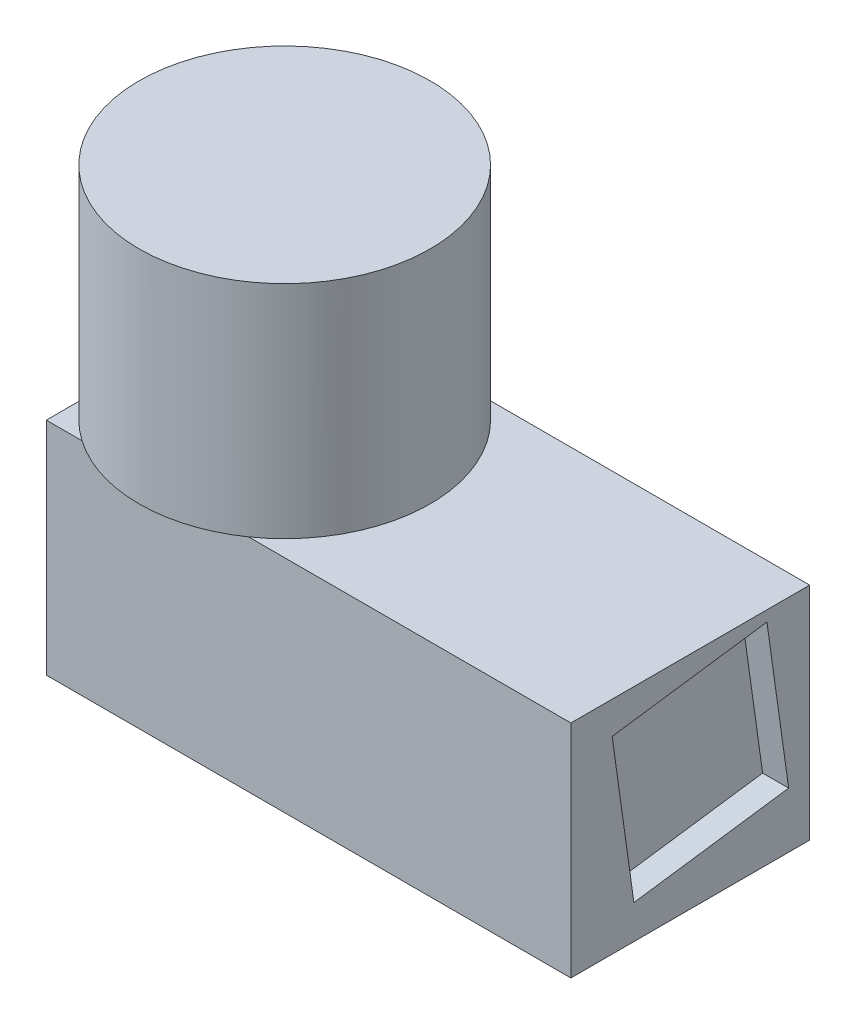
ISO-10303-21;
HEADER;
FILE_DESCRIPTION(('STEP AP214'),'2;1');
FILE_NAME('part.step','',(''),(''),'','','');
FILE_SCHEMA(('AUTOMOTIVE_DESIGN { 1 0 10303 214 1 1 1 1 }'));
ENDSEC;
DATA;
#1=APPLICATION_CONTEXT('core data for automotive mechanical design processes');
#2=APPLICATION_PROTOCOL_DEFINITION('international standard','automotive_design',2000,#1);
#3=PRODUCT_CONTEXT('',#1,'mechanical');
#4=PRODUCT('Part','Part','',(#3));
#5=PRODUCT_RELATED_PRODUCT_CATEGORY('part','',(#4));
#6=PRODUCT_DEFINITION_FORMATION('','',#4);
#7=PRODUCT_DEFINITION_CONTEXT('part definition',#1,'design');
#8=PRODUCT_DEFINITION('design','',#6,#7);
#9=PRODUCT_DEFINITION_SHAPE('','',#8);
#10=(LENGTH_UNIT() NAMED_UNIT(*) SI_UNIT(.MILLI.,.METRE.));
#11=(NAMED_UNIT(*) PLANE_ANGLE_UNIT() SI_UNIT($,.RADIAN.));
#12=(NAMED_UNIT(*) SI_UNIT($,.STERADIAN.) SOLID_ANGLE_UNIT());
#13=UNCERTAINTY_MEASURE_WITH_UNIT(LENGTH_MEASURE(1.E-05),#10,'distance_accuracy_value','');
#14=(GEOMETRIC_REPRESENTATION_CONTEXT(3) GLOBAL_UNCERTAINTY_ASSIGNED_CONTEXT((#13)) GLOBAL_UNIT_ASSIGNED_CONTEXT((#10,
#11,#12)) REPRESENTATION_CONTEXT('',''));
#15=CARTESIAN_POINT('',(0.,0.,0.));
#16=DIRECTION('',(0.,0.,1.));
#17=DIRECTION('',(1.,0.,0.));
#18=AXIS2_PLACEMENT_3D('',#15,#16,#17);
#19=CARTESIAN_POINT('',(0.,53.848,0.));
#20=DIRECTION('',(0.,-1.,0.));
#21=DIRECTION('',(0.,0.,-1.));
#22=AXIS2_PLACEMENT_3D('',#19,#20,#21);
#23=PLANE('',#22);
#24=CARTESIAN_POINT('',(-34.943095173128,53.848,0.));
#25=DIRECTION('',(0.,-1.,0.));
#26=DIRECTION('',(0.,0.,-1.));
#27=AXIS2_PLACEMENT_3D('',#24,#25,#26);
#28=CIRCLE('',#27,35.4944784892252);
#29=CARTESIAN_POINT('',(-63.9482717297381,53.848,20.4586836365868));
#30=VERTEX_POINT('',#29);
#31=CARTESIAN_POINT('',(-55.2485710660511,53.848,29.1126373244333));
#32=VERTEX_POINT('',#31);
#33=EDGE_CURVE('E134',#30,#32,#28,.F.);
#34=ORIENTED_EDGE('',*,*,#33,.F.);
#35=DIRECTION('',(0.,0.,1.));
#36=VECTOR('',#35,1.);
#37=CARTESIAN_POINT('',(-63.9482717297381,53.848,29.1126373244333));
#38=LINE('',#37,#36);
#39=CARTESIAN_POINT('',(-63.9482717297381,53.848,29.1126373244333));
#40=VERTEX_POINT('',#39);
#41=EDGE_CURVE('E173',#30,#40,#38,.T.);
#42=ORIENTED_EDGE('',*,*,#41,.T.);
#43=DIRECTION('',(1.,0.,0.));
#44=VECTOR('',#43,1.);
#45=CARTESIAN_POINT('',(-91.909930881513,53.848,29.1126373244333));
#46=LINE('',#45,#44);
#47=EDGE_CURVE('E146',#40,#32,#46,.T.);
#48=ORIENTED_EDGE('',*,*,#47,.T.);
#49=EDGE_LOOP('',(#34,#42,#48));
#50=FACE_BOUND('',#49,.T.);
#51=ADVANCED_FACE('F41',(#50),#23,.F.);
#52=CARTESIAN_POINT('',(-63.9482717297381,53.848,-20.4586836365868));
#53=VERTEX_POINT('',#52);
#54=EDGE_CURVE('E59',#53,#30,#38,.T.);
#55=ORIENTED_EDGE('',*,*,#54,.T.);
#56=EDGE_CURVE('E137',#53,#30,#28,.F.);
#57=ORIENTED_EDGE('',*,*,#56,.F.);
#58=EDGE_LOOP('',(#55,#57));
#59=FACE_BOUND('',#58,.T.);
#60=ADVANCED_FACE('F258',(#59),#23,.T.);
#61=CARTESIAN_POINT('',(-34.943095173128,53.848,0.));
#62=DIRECTION('',(0.,-1.,0.));
#63=DIRECTION('',(0.,0.,-1.));
#64=AXIS2_PLACEMENT_3D('',#61,#62,#63);
#65=CIRCLE('',#64,35.4944784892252);
#66=CARTESIAN_POINT('',(-14.6376192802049,53.848,29.1126373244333));
#67=VERTEX_POINT('',#66);
#68=CARTESIAN_POINT('',(-14.6376192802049,53.848,-29.1126373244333));
#69=VERTEX_POINT('',#68);
#70=EDGE_CURVE('E12',#67,#69,#65,.F.);
#71=ORIENTED_EDGE('',*,*,#70,.F.);
#72=DIRECTION('',(1.,0.,0.));
#73=VECTOR('',#72,1.);
#74=CARTESIAN_POINT('',(-91.909930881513,53.848,29.1126373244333));
#75=LINE('',#74,#73);
#76=CARTESIAN_POINT('',(63.9482717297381,53.848,29.1126373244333));
#77=VERTEX_POINT('',#76);
#78=EDGE_CURVE('E147',#67,#77,#75,.T.);
#79=ORIENTED_EDGE('',*,*,#78,.T.);
#80=DIRECTION('',(0.,0.,-1.));
#81=VECTOR('',#80,1.);
#82=CARTESIAN_POINT('',(63.9482717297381,53.848,29.1126373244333));
#83=LINE('',#82,#81);
#84=CARTESIAN_POINT('',(63.9482717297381,53.848,-29.1126373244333));
#85=VERTEX_POINT('',#84);
#86=EDGE_CURVE('E157',#77,#85,#83,.T.);
#87=ORIENTED_EDGE('',*,*,#86,.T.);
#88=DIRECTION('',(-1.,0.,0.));
#89=VECTOR('',#88,1.);
#90=CARTESIAN_POINT('',(-63.9482717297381,53.848,-29.1126373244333));
#91=LINE('',#90,#89);
#92=EDGE_CURVE('E169',#85,#69,#91,.T.);
#93=ORIENTED_EDGE('',*,*,#92,.T.);
#94=EDGE_LOOP('',(#71,#79,#87,#93));
#95=FACE_BOUND('',#94,.T.);
#96=ADVANCED_FACE('F240',(#95),#23,.F.);
#97=DIRECTION('',(1.,0.,0.));
#98=VECTOR('',#97,1.);
#99=CARTESIAN_POINT('',(-91.909930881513,53.848,29.1126373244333));
#100=LINE('',#99,#98);
#101=EDGE_CURVE('E143',#32,#67,#100,.T.);
#102=ORIENTED_EDGE('',*,*,#101,.T.);
#103=CARTESIAN_POINT('',(-34.943095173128,53.848,0.));
#104=DIRECTION('',(0.,-1.,0.));
#105=DIRECTION('',(0.,0.,-1.));
#106=AXIS2_PLACEMENT_3D('',#103,#104,#105);
#107=CIRCLE('',#106,35.4944784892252);
#108=EDGE_CURVE('E51',#32,#67,#107,.F.);
#109=ORIENTED_EDGE('',*,*,#108,.F.);
#110=EDGE_LOOP('',(#102,#109));
#111=FACE_BOUND('',#110,.T.);
#112=ADVANCED_FACE('F248',(#111),#23,.T.);
#113=CARTESIAN_POINT('',(-55.2485710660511,53.848,-29.1126373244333));
#114=VERTEX_POINT('',#113);
#115=EDGE_CURVE('E180',#69,#114,#91,.T.);
#116=ORIENTED_EDGE('',*,*,#115,.T.);
#117=CARTESIAN_POINT('',(-34.943095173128,53.848,0.));
#118=DIRECTION('',(0.,-1.,0.));
#119=DIRECTION('',(0.,0.,-1.));
#120=AXIS2_PLACEMENT_3D('',#117,#118,#119);
#121=CIRCLE('',#120,35.4944784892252);
#122=EDGE_CURVE('E129',#69,#114,#121,.F.);
#123=ORIENTED_EDGE('',*,*,#122,.F.);
#124=EDGE_LOOP('',(#116,#123));
#125=FACE_BOUND('',#124,.T.);
#126=ADVANCED_FACE('F245',(#125),#23,.T.);
#127=CARTESIAN_POINT('',(-63.9482717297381,53.848,-29.1126373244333));
#128=VERTEX_POINT('',#127);
#129=EDGE_CURVE('E154',#128,#53,#38,.T.);
#130=ORIENTED_EDGE('',*,*,#129,.T.);
#131=EDGE_CURVE('E132',#114,#53,#28,.F.);
#132=ORIENTED_EDGE('',*,*,#131,.F.);
#133=EDGE_CURVE('E181',#114,#128,#91,.T.);
#134=ORIENTED_EDGE('',*,*,#133,.T.);
#135=EDGE_LOOP('',(#130,#132,#134));
#136=FACE_BOUND('',#135,.T.);
#137=ADVANCED_FACE('F247',(#136),#23,.F.);
#138=CARTESIAN_POINT('',(-63.9482717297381,53.848,29.1126373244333));
#139=DIRECTION('',(1.,0.,0.));
#140=DIRECTION('',(0.,0.,-1.));
#141=AXIS2_PLACEMENT_3D('',#138,#139,#140);
#142=PLANE('',#141);
#143=DIRECTION('',(0.,0.,1.));
#144=VECTOR('',#143,1.);
#145=CARTESIAN_POINT('',(-63.9482717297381,0.,29.1126373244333));
#146=LINE('',#145,#144);
#147=CARTESIAN_POINT('',(-63.9482717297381,0.,-29.1126373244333));
#148=VERTEX_POINT('',#147);
#149=CARTESIAN_POINT('',(-63.9482717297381,0.,29.1126373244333));
#150=VERTEX_POINT('',#149);
#151=EDGE_CURVE('E142',#148,#150,#146,.T.);
#152=ORIENTED_EDGE('',*,*,#151,.T.);
#153=DIRECTION('',(0.,-1.,0.));
#154=VECTOR('',#153,1.);
#155=CARTESIAN_POINT('',(-63.9482717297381,53.848,29.1126373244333));
#156=LINE('',#155,#154);
#157=EDGE_CURVE('E133',#40,#150,#156,.T.);
#158=ORIENTED_EDGE('',*,*,#157,.F.);
#159=ORIENTED_EDGE('',*,*,#41,.F.);
#160=ORIENTED_EDGE('',*,*,#54,.F.);
#161=ORIENTED_EDGE('',*,*,#129,.F.);
#162=DIRECTION('',(0.,-1.,0.));
#163=VECTOR('',#162,1.);
#164=CARTESIAN_POINT('',(-63.9482717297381,53.848,-29.1126373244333));
#165=LINE('',#164,#163);
#166=EDGE_CURVE('E166',#128,#148,#165,.T.);
#167=ORIENTED_EDGE('',*,*,#166,.T.);
#168=EDGE_LOOP('',(#152,#158,#159,#160,#161,#167));
#169=FACE_BOUND('',#168,.T.);
#170=ADVANCED_FACE('F205',(#169),#142,.F.);
#171=CARTESIAN_POINT('',(-91.909930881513,53.848,29.1126373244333));
#172=DIRECTION('',(0.,0.,-1.));
#173=DIRECTION('',(-1.,0.,0.));
#174=AXIS2_PLACEMENT_3D('',#171,#172,#173);
#175=PLANE('',#174);
#176=DIRECTION('',(1.,0.,0.));
#177=VECTOR('',#176,1.);
#178=CARTESIAN_POINT('',(-91.909930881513,0.,29.1126373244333));
#179=LINE('',#178,#177);
#180=CARTESIAN_POINT('',(63.9482717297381,0.,29.1126373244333));
#181=VERTEX_POINT('',#180);
#182=EDGE_CURVE('E160',#150,#181,#179,.T.);
#183=ORIENTED_EDGE('',*,*,#182,.T.);
#184=DIRECTION('',(0.,-1.,0.));
#185=VECTOR('',#184,1.);
#186=CARTESIAN_POINT('',(63.9482717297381,53.848,29.1126373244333));
#187=LINE('',#186,#185);
#188=EDGE_CURVE('E148',#77,#181,#187,.T.);
#189=ORIENTED_EDGE('',*,*,#188,.F.);
#190=ORIENTED_EDGE('',*,*,#78,.F.);
#191=ORIENTED_EDGE('',*,*,#101,.F.);
#192=ORIENTED_EDGE('',*,*,#47,.F.);
#193=ORIENTED_EDGE('',*,*,#157,.T.);
#194=EDGE_LOOP('',(#183,#189,#190,#191,#192,#193));
#195=FACE_BOUND('',#194,.T.);
#196=ADVANCED_FACE('F203',(#195),#175,.F.);
#197=CARTESIAN_POINT('',(63.9482717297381,53.848,29.1126373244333));
#198=DIRECTION('',(-1.,0.,0.));
#199=DIRECTION('',(0.,0.,1.));
#200=AXIS2_PLACEMENT_3D('',#197,#198,#199);
#201=PLANE('',#200);
#202=DIRECTION('',(0.,0.139173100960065,-0.99026806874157));
#203=VECTOR('',#202,1.);
#204=CARTESIAN_POINT('',(63.9482717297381,8.24478658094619,13.7475048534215));
#205=LINE('',#204,#203);
#206=CARTESIAN_POINT('',(63.9482717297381,8.24478658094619,13.7475048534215));
#207=VERTEX_POINT('',#206);
#208=CARTESIAN_POINT('',(63.9482717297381,13.5472817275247,-23.9817085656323));
#209=VERTEX_POINT('',#208);
#210=EDGE_CURVE('E45',#207,#209,#205,.T.);
#211=ORIENTED_EDGE('',*,*,#210,.F.);
#212=DIRECTION('',(0.,-0.99026806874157,-0.139173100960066));
#213=VECTOR('',#212,1.);
#214=CARTESIAN_POINT('',(63.9482717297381,45.974,19.05));
#215=LINE('',#214,#213);
#216=CARTESIAN_POINT('',(63.9482717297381,45.974,19.05));
#217=VERTEX_POINT('',#216);
#218=EDGE_CURVE('E106',#217,#207,#215,.T.);
#219=ORIENTED_EDGE('',*,*,#218,.F.);
#220=DIRECTION('',(0.,-0.139173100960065,0.99026806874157));
#221=VECTOR('',#220,1.);
#222=CARTESIAN_POINT('',(63.9482717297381,45.974,19.05));
#223=LINE('',#222,#221);
#224=CARTESIAN_POINT('',(63.9482717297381,51.2764951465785,-18.6792134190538));
#225=VERTEX_POINT('',#224);
#226=EDGE_CURVE('E110',#225,#217,#223,.T.);
#227=ORIENTED_EDGE('',*,*,#226,.F.);
#228=DIRECTION('',(0.,0.99026806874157,0.139173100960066));
#229=VECTOR('',#228,1.);
#230=CARTESIAN_POINT('',(63.9482717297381,51.2764951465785,-18.6792134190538));
#231=LINE('',#230,#229);
#232=EDGE_CURVE('E91',#209,#225,#231,.T.);
#233=ORIENTED_EDGE('',*,*,#232,.F.);
#234=EDGE_LOOP('',(#211,#219,#227,#233));
#235=FACE_BOUND('',#234,.T.);
#236=DIRECTION('',(0.,0.,-1.));
#237=VECTOR('',#236,1.);
#238=CARTESIAN_POINT('',(63.9482717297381,0.,29.1126373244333));
#239=LINE('',#238,#237);
#240=CARTESIAN_POINT('',(63.9482717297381,0.,-29.1126373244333));
#241=VERTEX_POINT('',#240);
#242=EDGE_CURVE('E163',#181,#241,#239,.T.);
#243=ORIENTED_EDGE('',*,*,#242,.T.);
#244=DIRECTION('',(0.,-1.,0.));
#245=VECTOR('',#244,1.);
#246=CARTESIAN_POINT('',(63.9482717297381,53.848,-29.1126373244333));
#247=LINE('',#246,#245);
#248=EDGE_CURVE('E151',#85,#241,#247,.T.);
#249=ORIENTED_EDGE('',*,*,#248,.F.);
#250=ORIENTED_EDGE('',*,*,#86,.F.);
#251=ORIENTED_EDGE('',*,*,#188,.T.);
#252=EDGE_LOOP('',(#243,#249,#250,#251));
#253=FACE_BOUND('',#252,.T.);
#254=ADVANCED_FACE('F107',(#235,#253),#201,.F.);
#255=CARTESIAN_POINT('',(-63.9482717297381,53.848,-29.1126373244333));
#256=DIRECTION('',(0.,0.,1.));
#257=DIRECTION('',(1.,0.,0.));
#258=AXIS2_PLACEMENT_3D('',#255,#256,#257);
#259=PLANE('',#258);
#260=DIRECTION('',(-1.,0.,0.));
#261=VECTOR('',#260,1.);
#262=CARTESIAN_POINT('',(-63.9482717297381,0.,-29.1126373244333));
#263=LINE('',#262,#261);
#264=EDGE_CURVE('E170',#241,#148,#263,.T.);
#265=ORIENTED_EDGE('',*,*,#264,.T.);
#266=ORIENTED_EDGE('',*,*,#166,.F.);
#267=ORIENTED_EDGE('',*,*,#133,.F.);
#268=ORIENTED_EDGE('',*,*,#115,.F.);
#269=ORIENTED_EDGE('',*,*,#92,.F.);
#270=ORIENTED_EDGE('',*,*,#248,.T.);
#271=EDGE_LOOP('',(#265,#266,#267,#268,#269,#270));
#272=FACE_BOUND('',#271,.T.);
#273=ADVANCED_FACE('F244',(#272),#259,.F.);
#274=CARTESIAN_POINT('',(0.,0.,0.));
#275=DIRECTION('',(0.,-1.,0.));
#276=DIRECTION('',(0.,0.,-1.));
#277=AXIS2_PLACEMENT_3D('',#274,#275,#276);
#278=PLANE('',#277);
#279=ORIENTED_EDGE('',*,*,#151,.F.);
#280=ORIENTED_EDGE('',*,*,#264,.F.);
#281=ORIENTED_EDGE('',*,*,#242,.F.);
#282=ORIENTED_EDGE('',*,*,#182,.F.);
#283=EDGE_LOOP('',(#279,#280,#281,#282));
#284=FACE_BOUND('',#283,.T.);
#285=ADVANCED_FACE('F213',(#284),#278,.T.);
#286=CARTESIAN_POINT('',(-34.943095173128,107.696,0.));
#287=DIRECTION('',(0.,-1.,0.));
#288=DIRECTION('',(0.,0.,-1.));
#289=AXIS2_PLACEMENT_3D('',#286,#287,#288);
#290=CYLINDRICAL_SURFACE('',#289,35.4944784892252);
#291=CARTESIAN_POINT('',(-34.943095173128,107.696,0.));
#292=DIRECTION('',(0.,1.,0.));
#293=DIRECTION('',(0.,0.,1.));
#294=AXIS2_PLACEMENT_3D('',#291,#292,#293);
#295=CIRCLE('',#294,35.4944784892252);
#296=CARTESIAN_POINT('',(-34.943095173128,107.696,35.4944784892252));
#297=VERTEX_POINT('',#296);
#298=EDGE_CURVE('E125',#297,#297,#295,.T.);
#299=ORIENTED_EDGE('',*,*,#298,.F.);
#300=EDGE_LOOP('',(#299));
#301=FACE_BOUND('',#300,.T.);
#302=ORIENTED_EDGE('',*,*,#70,.T.);
#303=ORIENTED_EDGE('',*,*,#122,.T.);
#304=ORIENTED_EDGE('',*,*,#131,.T.);
#305=ORIENTED_EDGE('',*,*,#56,.T.);
#306=ORIENTED_EDGE('',*,*,#33,.T.);
#307=ORIENTED_EDGE('',*,*,#108,.T.);
#308=EDGE_LOOP('',(#302,#303,#304,#305,#306,#307));
#309=FACE_BOUND('',#308,.T.);
#310=ADVANCED_FACE('F316',(#301,#309),#290,.T.);
#311=CARTESIAN_POINT('',(0.,107.696,0.));
#312=DIRECTION('',(0.,1.,0.));
#313=DIRECTION('',(0.,0.,1.));
#314=AXIS2_PLACEMENT_3D('',#311,#312,#313);
#315=PLANE('',#314);
#316=ORIENTED_EDGE('',*,*,#298,.T.);
#317=EDGE_LOOP('',(#316));
#318=FACE_BOUND('',#317,.T.);
#319=ADVANCED_FACE('F320',(#318),#315,.T.);
#320=CARTESIAN_POINT('',(57.5982717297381,45.974,19.05));
#321=DIRECTION('',(0.,-0.139173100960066,0.99026806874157));
#322=DIRECTION('',(0.,-0.99026806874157,-0.139173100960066));
#323=AXIS2_PLACEMENT_3D('',#320,#321,#322);
#324=PLANE('',#323);
#325=ORIENTED_EDGE('',*,*,#218,.T.);
#326=DIRECTION('',(1.,0.,0.));
#327=VECTOR('',#326,1.);
#328=CARTESIAN_POINT('',(57.5982717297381,8.24478658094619,13.7475048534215));
#329=LINE('',#328,#327);
#330=CARTESIAN_POINT('',(57.5982717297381,8.24478658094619,13.7475048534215));
#331=VERTEX_POINT('',#330);
#332=EDGE_CURVE('E99',#331,#207,#329,.T.);
#333=ORIENTED_EDGE('',*,*,#332,.F.);
#334=DIRECTION('',(0.,-0.99026806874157,-0.139173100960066));
#335=VECTOR('',#334,1.);
#336=CARTESIAN_POINT('',(57.5982717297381,45.974,19.05));
#337=LINE('',#336,#335);
#338=CARTESIAN_POINT('',(57.5982717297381,45.974,19.05));
#339=VERTEX_POINT('',#338);
#340=EDGE_CURVE('E111',#339,#331,#337,.T.);
#341=ORIENTED_EDGE('',*,*,#340,.F.);
#342=DIRECTION('',(1.,0.,0.));
#343=VECTOR('',#342,1.);
#344=CARTESIAN_POINT('',(57.5982717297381,45.974,19.05));
#345=LINE('',#344,#343);
#346=EDGE_CURVE('E121',#339,#217,#345,.T.);
#347=ORIENTED_EDGE('',*,*,#346,.T.);
#348=EDGE_LOOP('',(#325,#333,#341,#347));
#349=FACE_BOUND('',#348,.T.);
#350=ADVANCED_FACE('F330',(#349),#324,.F.);
#351=CARTESIAN_POINT('',(57.5982717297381,45.974,19.05));
#352=DIRECTION('',(0.,0.99026806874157,0.139173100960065));
#353=DIRECTION('',(0.,-0.139173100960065,0.99026806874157));
#354=AXIS2_PLACEMENT_3D('',#351,#352,#353);
#355=PLANE('',#354);
#356=ORIENTED_EDGE('',*,*,#226,.T.);
#357=ORIENTED_EDGE('',*,*,#346,.F.);
#358=DIRECTION('',(0.,-0.139173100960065,0.99026806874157));
#359=VECTOR('',#358,1.);
#360=CARTESIAN_POINT('',(57.5982717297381,45.974,19.05));
#361=LINE('',#360,#359);
#362=CARTESIAN_POINT('',(57.5982717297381,51.2764951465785,-18.6792134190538));
#363=VERTEX_POINT('',#362);
#364=EDGE_CURVE('E117',#363,#339,#361,.T.);
#365=ORIENTED_EDGE('',*,*,#364,.F.);
#366=DIRECTION('',(1.,0.,0.));
#367=VECTOR('',#366,1.);
#368=CARTESIAN_POINT('',(57.5982717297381,51.2764951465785,-18.6792134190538));
#369=LINE('',#368,#367);
#370=EDGE_CURVE('E98',#363,#225,#369,.T.);
#371=ORIENTED_EDGE('',*,*,#370,.T.);
#372=EDGE_LOOP('',(#356,#357,#365,#371));
#373=FACE_BOUND('',#372,.T.);
#374=ADVANCED_FACE('F345',(#373),#355,.F.);
#375=CARTESIAN_POINT('',(57.5982717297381,51.2764951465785,-18.6792134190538));
#376=DIRECTION('',(0.,0.139173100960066,-0.99026806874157));
#377=DIRECTION('',(0.,0.99026806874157,0.139173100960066));
#378=AXIS2_PLACEMENT_3D('',#375,#376,#377);
#379=PLANE('',#378);
#380=ORIENTED_EDGE('',*,*,#232,.T.);
#381=ORIENTED_EDGE('',*,*,#370,.F.);
#382=DIRECTION('',(0.,0.99026806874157,0.139173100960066));
#383=VECTOR('',#382,1.);
#384=CARTESIAN_POINT('',(57.5982717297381,51.2764951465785,-18.6792134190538));
#385=LINE('',#384,#383);
#386=CARTESIAN_POINT('',(57.5982717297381,13.5472817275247,-23.9817085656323));
#387=VERTEX_POINT('',#386);
#388=EDGE_CURVE('E94',#387,#363,#385,.T.);
#389=ORIENTED_EDGE('',*,*,#388,.F.);
#390=DIRECTION('',(1.,0.,0.));
#391=VECTOR('',#390,1.);
#392=CARTESIAN_POINT('',(57.5982717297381,13.5472817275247,-23.9817085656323));
#393=LINE('',#392,#391);
#394=EDGE_CURVE('E88',#387,#209,#393,.T.);
#395=ORIENTED_EDGE('',*,*,#394,.T.);
#396=EDGE_LOOP('',(#380,#381,#389,#395));
#397=FACE_BOUND('',#396,.T.);
#398=ADVANCED_FACE('F43',(#397),#379,.F.);
#399=CARTESIAN_POINT('',(57.5982717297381,8.24478658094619,13.7475048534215));
#400=DIRECTION('',(0.,-0.99026806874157,-0.139173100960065));
#401=DIRECTION('',(0.,0.139173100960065,-0.99026806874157));
#402=AXIS2_PLACEMENT_3D('',#399,#400,#401);
#403=PLANE('',#402);
#404=ORIENTED_EDGE('',*,*,#210,.T.);
#405=ORIENTED_EDGE('',*,*,#394,.F.);
#406=DIRECTION('',(0.,0.139173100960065,-0.99026806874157));
#407=VECTOR('',#406,1.);
#408=CARTESIAN_POINT('',(57.5982717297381,8.24478658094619,13.7475048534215));
#409=LINE('',#408,#407);
#410=EDGE_CURVE('E118',#331,#387,#409,.T.);
#411=ORIENTED_EDGE('',*,*,#410,.F.);
#412=ORIENTED_EDGE('',*,*,#332,.T.);
#413=EDGE_LOOP('',(#404,#405,#411,#412));
#414=FACE_BOUND('',#413,.T.);
#415=ADVANCED_FACE('F103',(#414),#403,.F.);
#416=CARTESIAN_POINT('',(57.5982717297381,3.09866338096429,-6.21295085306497));
#417=DIRECTION('',(1.,0.,0.));
#418=DIRECTION('',(0.,0.139173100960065,-0.99026806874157));
#419=AXIS2_PLACEMENT_3D('',#416,#417,#418);
#420=PLANE('',#419);
#421=ORIENTED_EDGE('',*,*,#340,.T.);
#422=ORIENTED_EDGE('',*,*,#410,.T.);
#423=ORIENTED_EDGE('',*,*,#388,.T.);
#424=ORIENTED_EDGE('',*,*,#364,.T.);
#425=EDGE_LOOP('',(#421,#422,#423,#424));
#426=FACE_BOUND('',#425,.T.);
#427=ADVANCED_FACE('F370',(#426),#420,.T.);
#428=CLOSED_SHELL('',(#51,#60,#96,#112,#126,#137,#170,#196,#254,#273,#285,#310,#319,#350,#374,
#398,#415,#427));
#429=MANIFOLD_SOLID_BREP('B2',#428);
#430=ADVANCED_BREP_SHAPE_REPRESENTATION('',(#18,#429),#14);
#431=SHAPE_DEFINITION_REPRESENTATION(#9,#430);
ENDSEC;
END-ISO-10303-21;
